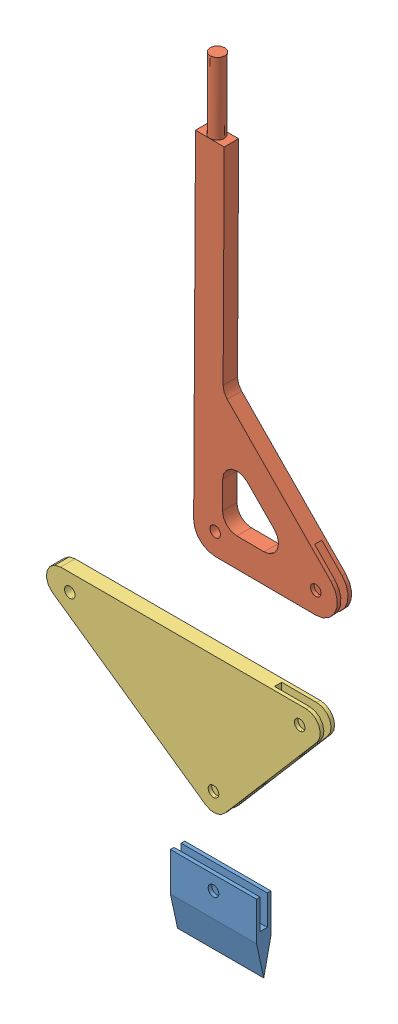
SolidWorks assembly wood splitter.SLDASM, configuration Simulation configuration (file format 15000). Lengths in mm.
Overall size (514.48 1377.24 25.4).
7 component instances, 7 part files, 16 mates.
Components (placement in the parent):
- pin1-1: pin1.SLDPRT [Default] at origin (suppressed, hidden)
- pin2-1: pin2.SLDPRT [Default] at origin (suppressed, hidden)
- Link2-1: Link2.SLDPRT [Default] at origin (suppressed, hidden)
- Blade-1: Blade.SLDPRT [Default] at origin
- Link1-1: Link1.SLDPRT [Default] at origin (suppressed, hidden)
- Hand Link-1: Hand Link.SLDPRT [Default] at origin
- Center Link-1: Center Link.SLDPRT [Default] at origin
Mates (geometry in assembly coordinates):
- Concentric1: concentric aligned: cylinder of pin1-1 through (0 0 25.4) axis (0 0 -1) radius 9.525; cylinder of Center Link-1 through (0 0 12.7) axis (0 0 -1) radius 9.525
- Width1: width aligned: plane of pin1-1 through (0 0 25.4) normal (0 0 1); plane of pin1-1 through (0 0 -25.4) normal (0 0 -1); plane of Center Link-1 through (398.2693 -125.171 12.7) normal (0 0 1); plane of Center Link-1 through (398.2693 -125.171 -12.7) normal (0 0 -1)
- Concentric2: concentric aligned: cylinder of Link2-1 through (254 -384.4464 6.35) axis (0 0 -1) radius 9.525; cylinder of Blade-1 through (254 -384.4464 12.7) axis (0 0 -1) radius 9.525
- Coincident2: coincident anti-aligned: plane of Link2-1 through (186.0002 -248.058 6.35) normal (0 0 1); plane of Blade-1 through (330.2 -304.7959 6.35) normal (0 0 -1)
- Concentric3: concentric aligned: cylinder of Link2-1 through (186.0002 -248.058 6.35) axis (0 0 -1) radius 9.525; cylinder of Center Link-1 through (186.0002 -248.058 12.7) axis (0 0 -1) radius 9.525
- Coincident3: coincident anti-aligned: plane of Link2-1 through (186.0002 -248.058 6.35) normal (0 0 1); plane of Center Link-1 through (0 0 6.35) normal (0 0 -1)
- Concentric4: concentric aligned: cylinder of Link1-1 through (386.1915 -126.5588 6.35) axis (0 0 -1) radius 9.525; cylinder of Center Link-1 through (386.1915 -126.5588 12.7) axis (0 0 -1) radius 9.525
- Coincident4: coincident anti-aligned: plane of Link1-1 through (382.7852 95.6826 -6.35) normal (0 0 -1); plane of Center Link-1 through (0 0 -6.35) normal (0 0 1)
- Concentric5: concentric aligned: cylinder of Link1-1 through (382.7852 95.6826 6.35) axis (0 0 -1) radius 9.525; cylinder of Hand Link-1 through (382.7852 95.6826 12.7) axis (0 0 -1) radius 9.525
- Coincident5: coincident anti-aligned: plane of Link1-1 through (382.7852 95.6826 6.35) normal (0 0 1); plane of Hand Link-1 through (-81.4006 244.7712 6.35) normal (0 0 -1)
- Concentric6: concentric aligned: cylinder of pin2-1 through (257.0597 221.4081 25.4) axis (0 0 -1) radius 9.525; cylinder of Hand Link-1 through (257.0597 221.4081 12.7) axis (0 0 -1) radius 9.525
- Parallel1: parallel anti-aligned: plane of Blade-1 through (177.8 -359.0464 12.7) normal (-1 0 0)
- Distance1: distance = 177.8 mm: plane of assembly through (0 0 0) normal (1 0 0); plane of assembly; plane of Blade-1 through (177.8 -359.0464 12.7) normal (-1 0 0)
- Angle2: planar angle = 0.785398 rad: plane of assembly through (0 0 0) normal (1 0 0); plane of Hand Link-1 through (217.7446 -1.1881 12.7) normal (-0.999985 0.005456 0); plane of assembly
- Angle3: planar angle = 0.785398 rad anti-aligned: plane of Hand Link-1 through (72.5703 90.8002 12.7) normal (-0.707107 0.707107 0); plane of assembly through (0 0 0) normal (1 0 0)
- Parallel2: parallel: plane of assembly through (0 0 0) normal (1 0 0); plane of Hand Link-1 through (218.9597 -1.3993 12.7) normal (-1 0 0); plane of assembly
